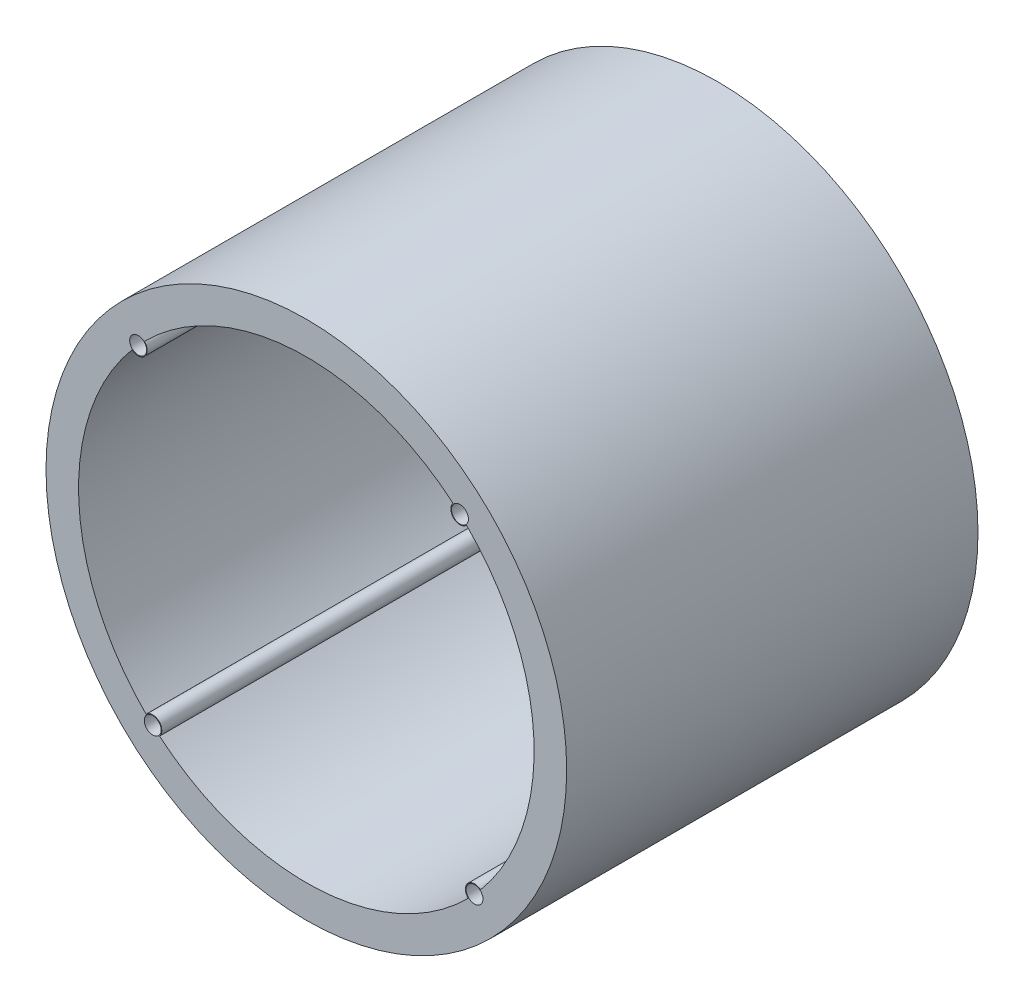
ISO-10303-21;
HEADER;
FILE_DESCRIPTION(('STEP AP214'),'2;1');
FILE_NAME('part.step','',(''),(''),'','','');
FILE_SCHEMA(('AUTOMOTIVE_DESIGN { 1 0 10303 214 1 1 1 1 }'));
ENDSEC;
DATA;
#1=APPLICATION_CONTEXT('core data for automotive mechanical design processes');
#2=APPLICATION_PROTOCOL_DEFINITION('international standard','automotive_design',2000,#1);
#3=PRODUCT_CONTEXT('',#1,'mechanical');
#4=PRODUCT('Part','Part','',(#3));
#5=PRODUCT_RELATED_PRODUCT_CATEGORY('part','',(#4));
#6=PRODUCT_DEFINITION_FORMATION('','',#4);
#7=PRODUCT_DEFINITION_CONTEXT('part definition',#1,'design');
#8=PRODUCT_DEFINITION('design','',#6,#7);
#9=PRODUCT_DEFINITION_SHAPE('','',#8);
#10=(LENGTH_UNIT() NAMED_UNIT(*) SI_UNIT(.MILLI.,.METRE.));
#11=(NAMED_UNIT(*) PLANE_ANGLE_UNIT() SI_UNIT($,.RADIAN.));
#12=(NAMED_UNIT(*) SI_UNIT($,.STERADIAN.) SOLID_ANGLE_UNIT());
#13=UNCERTAINTY_MEASURE_WITH_UNIT(LENGTH_MEASURE(1.E-05),#10,'distance_accuracy_value','');
#14=(GEOMETRIC_REPRESENTATION_CONTEXT(3) GLOBAL_UNCERTAINTY_ASSIGNED_CONTEXT((#13)) GLOBAL_UNIT_ASSIGNED_CONTEXT((#10,
#11,#12)) REPRESENTATION_CONTEXT('',''));
#15=CARTESIAN_POINT('',(0.,0.,0.));
#16=DIRECTION('',(0.,0.,1.));
#17=DIRECTION('',(1.,0.,0.));
#18=AXIS2_PLACEMENT_3D('',#15,#16,#17);
#19=CARTESIAN_POINT('',(0.,0.,0.));
#20=DIRECTION('',(0.,0.,1.));
#21=DIRECTION('',(1.,0.,0.));
#22=AXIS2_PLACEMENT_3D('',#19,#20,#21);
#23=CYLINDRICAL_SURFACE('',#22,44.45);
#24=CARTESIAN_POINT('',(0.,0.,0.));
#25=DIRECTION('',(0.,0.,1.));
#26=DIRECTION('',(1.,0.,0.));
#27=AXIS2_PLACEMENT_3D('',#24,#25,#26);
#28=CIRCLE('',#27,44.45);
#29=CARTESIAN_POINT('',(33.9917518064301,-28.6419850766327,0.));
#30=VERTEX_POINT('',#29);
#31=CARTESIAN_POINT('',(31.2669885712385,31.5939539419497,0.));
#32=VERTEX_POINT('',#31);
#33=EDGE_CURVE('E55',#30,#32,#28,.T.);
#34=ORIENTED_EDGE('',*,*,#33,.F.);
#35=DIRECTION('',(0.,0.,1.));
#36=VECTOR('',#35,1.);
#37=CARTESIAN_POINT('',(33.9917518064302,-28.6419850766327,40.1319999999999));
#38=LINE('',#37,#36);
#39=CARTESIAN_POINT('',(33.9917518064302,-28.6419850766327,80.2639999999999));
#40=VERTEX_POINT('',#39);
#41=EDGE_CURVE('E110',#30,#40,#38,.T.);
#42=ORIENTED_EDGE('',*,*,#41,.T.);
#43=CARTESIAN_POINT('',(0.,0.,80.2639999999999));
#44=DIRECTION('',(0.,0.,1.));
#45=DIRECTION('',(1.,0.,0.));
#46=AXIS2_PLACEMENT_3D('',#43,#44,#45);
#47=CIRCLE('',#46,44.45);
#48=CARTESIAN_POINT('',(31.2669885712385,31.5939539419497,80.2639999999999));
#49=VERTEX_POINT('',#48);
#50=EDGE_CURVE('E98',#40,#49,#47,.T.);
#51=ORIENTED_EDGE('',*,*,#50,.T.);
#52=DIRECTION('',(0.,0.,1.));
#53=VECTOR('',#52,1.);
#54=CARTESIAN_POINT('',(31.2669885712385,31.5939539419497,40.1319999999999));
#55=LINE('',#54,#53);
#56=EDGE_CURVE('E151',#49,#32,#55,.F.);
#57=ORIENTED_EDGE('',*,*,#56,.T.);
#58=EDGE_LOOP('',(#34,#42,#51,#57));
#59=FACE_BOUND('',#58,.T.);
#60=ADVANCED_FACE('F32',(#59),#23,.F.);
#61=CARTESIAN_POINT('',(-33.9917518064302,28.6419850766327,0.));
#62=VERTEX_POINT('',#61);
#63=CARTESIAN_POINT('',(-31.2669885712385,-31.5939539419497,0.));
#64=VERTEX_POINT('',#63);
#65=EDGE_CURVE('E145',#62,#64,#28,.T.);
#66=ORIENTED_EDGE('',*,*,#65,.F.);
#67=DIRECTION('',(0.,0.,1.));
#68=VECTOR('',#67,1.);
#69=CARTESIAN_POINT('',(-33.9917518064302,28.6419850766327,40.1319999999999));
#70=LINE('',#69,#68);
#71=CARTESIAN_POINT('',(-33.9917518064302,28.6419850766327,80.2639999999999));
#72=VERTEX_POINT('',#71);
#73=EDGE_CURVE('E11',#62,#72,#70,.T.);
#74=ORIENTED_EDGE('',*,*,#73,.T.);
#75=CARTESIAN_POINT('',(-31.2669885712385,-31.5939539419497,80.2639999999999));
#76=VERTEX_POINT('',#75);
#77=EDGE_CURVE('E108',#72,#76,#47,.T.);
#78=ORIENTED_EDGE('',*,*,#77,.T.);
#79=DIRECTION('',(0.,0.,1.));
#80=VECTOR('',#79,1.);
#81=CARTESIAN_POINT('',(-31.2669885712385,-31.5939539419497,40.1319999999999));
#82=LINE('',#81,#80);
#83=EDGE_CURVE('E158',#76,#64,#82,.F.);
#84=ORIENTED_EDGE('',*,*,#83,.T.);
#85=EDGE_LOOP('',(#66,#74,#78,#84));
#86=FACE_BOUND('',#85,.T.);
#87=ADVANCED_FACE('F177',(#86),#23,.F.);
#88=CARTESIAN_POINT('',(-28.6419850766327,-33.9917518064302,80.2639999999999));
#89=VERTEX_POINT('',#88);
#90=CARTESIAN_POINT('',(31.5939539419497,-31.2669885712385,80.2639999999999));
#91=VERTEX_POINT('',#90);
#92=EDGE_CURVE('E47',#89,#91,#47,.T.);
#93=ORIENTED_EDGE('',*,*,#92,.T.);
#94=DIRECTION('',(0.,0.,1.));
#95=VECTOR('',#94,1.);
#96=CARTESIAN_POINT('',(31.5939539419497,-31.2669885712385,40.1319999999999));
#97=LINE('',#96,#95);
#98=CARTESIAN_POINT('',(31.5939539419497,-31.2669885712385,0.));
#99=VERTEX_POINT('',#98);
#100=EDGE_CURVE('E115',#91,#99,#97,.F.);
#101=ORIENTED_EDGE('',*,*,#100,.T.);
#102=CARTESIAN_POINT('',(-28.6419850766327,-33.9917518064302,0.));
#103=VERTEX_POINT('',#102);
#104=EDGE_CURVE('E146',#103,#99,#28,.T.);
#105=ORIENTED_EDGE('',*,*,#104,.F.);
#106=DIRECTION('',(0.,0.,1.));
#107=VECTOR('',#106,1.);
#108=CARTESIAN_POINT('',(-28.6419850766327,-33.9917518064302,40.1319999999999));
#109=LINE('',#108,#107);
#110=EDGE_CURVE('E161',#103,#89,#109,.T.);
#111=ORIENTED_EDGE('',*,*,#110,.T.);
#112=EDGE_LOOP('',(#93,#101,#105,#111));
#113=FACE_BOUND('',#112,.T.);
#114=ADVANCED_FACE('F192',(#113),#23,.F.);
#115=CARTESIAN_POINT('',(0.,0.,80.2639999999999));
#116=DIRECTION('',(0.,0.,-1.));
#117=DIRECTION('',(-1.,0.,0.));
#118=AXIS2_PLACEMENT_3D('',#115,#116,#117);
#119=CYLINDRICAL_SURFACE('',#118,50.8);
#120=CARTESIAN_POINT('',(0.,0.,80.2639999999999));
#121=DIRECTION('',(0.,0.,1.));
#122=DIRECTION('',(1.,0.,0.));
#123=AXIS2_PLACEMENT_3D('',#120,#121,#122);
#124=CIRCLE('',#123,50.8);
#125=CARTESIAN_POINT('',(50.8,0.,80.2639999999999));
#126=VERTEX_POINT('',#125);
#127=EDGE_CURVE('E148',#126,#126,#124,.T.);
#128=ORIENTED_EDGE('',*,*,#127,.F.);
#129=EDGE_LOOP('',(#128));
#130=FACE_BOUND('',#129,.T.);
#131=CARTESIAN_POINT('',(0.,0.,0.));
#132=DIRECTION('',(0.,0.,1.));
#133=DIRECTION('',(1.,0.,0.));
#134=AXIS2_PLACEMENT_3D('',#131,#132,#133);
#135=CIRCLE('',#134,50.8);
#136=CARTESIAN_POINT('',(50.8,0.,0.));
#137=VERTEX_POINT('',#136);
#138=EDGE_CURVE('E144',#137,#137,#135,.T.);
#139=ORIENTED_EDGE('',*,*,#138,.T.);
#140=EDGE_LOOP('',(#139));
#141=FACE_BOUND('',#140,.T.);
#142=ADVANCED_FACE('F34',(#130,#141),#119,.T.);
#143=CARTESIAN_POINT('',(0.,0.,80.2639999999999));
#144=DIRECTION('',(0.,0.,1.));
#145=DIRECTION('',(1.,0.,0.));
#146=AXIS2_PLACEMENT_3D('',#143,#144,#145);
#147=PLANE('',#146);
#148=CARTESIAN_POINT('',(32.8191081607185,-29.9784695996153,80.2639999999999));
#149=DIRECTION('',(0.,0.,1.));
#150=DIRECTION('',(1.,0.,0.));
#151=AXIS2_PLACEMENT_3D('',#148,#149,#150);
#152=CIRCLE('',#151,1.651);
#153=CARTESIAN_POINT('',(34.4701081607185,-29.9784695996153,80.2639999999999));
#154=VERTEX_POINT('',#153);
#155=EDGE_CURVE('E235',#154,#154,#152,.T.);
#156=ORIENTED_EDGE('',*,*,#155,.F.);
#157=EDGE_LOOP('',(#156));
#158=FACE_BOUND('',#157,.T.);
#159=CARTESIAN_POINT('',(-29.9784695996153,-32.8191081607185,80.2639999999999));
#160=DIRECTION('',(0.,0.,1.));
#161=DIRECTION('',(1.,0.,0.));
#162=AXIS2_PLACEMENT_3D('',#159,#160,#161);
#163=CIRCLE('',#162,1.651);
#164=CARTESIAN_POINT('',(-28.3274695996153,-32.8191081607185,80.2639999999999));
#165=VERTEX_POINT('',#164);
#166=EDGE_CURVE('E231',#165,#165,#163,.T.);
#167=ORIENTED_EDGE('',*,*,#166,.F.);
#168=EDGE_LOOP('',(#167));
#169=FACE_BOUND('',#168,.T.);
#170=CARTESIAN_POINT('',(-32.8191081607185,29.9784695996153,80.2639999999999));
#171=DIRECTION('',(0.,0.,1.));
#172=DIRECTION('',(1.,0.,0.));
#173=AXIS2_PLACEMENT_3D('',#170,#171,#172);
#174=CIRCLE('',#173,1.651);
#175=CARTESIAN_POINT('',(-31.1681081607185,29.9784695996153,80.2639999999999));
#176=VERTEX_POINT('',#175);
#177=EDGE_CURVE('E226',#176,#176,#174,.T.);
#178=ORIENTED_EDGE('',*,*,#177,.F.);
#179=EDGE_LOOP('',(#178));
#180=FACE_BOUND('',#179,.T.);
#181=CARTESIAN_POINT('',(29.9784695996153,32.8191081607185,80.2639999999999));
#182=DIRECTION('',(0.,0.,1.));
#183=DIRECTION('',(1.,0.,0.));
#184=AXIS2_PLACEMENT_3D('',#181,#182,#183);
#185=CIRCLE('',#184,1.651);
#186=CARTESIAN_POINT('',(31.6294695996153,32.8191081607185,80.2639999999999));
#187=VERTEX_POINT('',#186);
#188=EDGE_CURVE('E123',#187,#187,#185,.T.);
#189=ORIENTED_EDGE('',*,*,#188,.F.);
#190=EDGE_LOOP('',(#189));
#191=FACE_BOUND('',#190,.T.);
#192=ORIENTED_EDGE('',*,*,#50,.F.);
#193=CARTESIAN_POINT('',(32.8191081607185,-29.9784695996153,80.2639999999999));
#194=DIRECTION('',(0.,0.,1.));
#195=DIRECTION('',(1.,0.,0.));
#196=AXIS2_PLACEMENT_3D('',#193,#194,#195);
#197=CIRCLE('',#196,1.778);
#198=EDGE_CURVE('E102',#40,#91,#197,.T.);
#199=ORIENTED_EDGE('',*,*,#198,.T.);
#200=ORIENTED_EDGE('',*,*,#92,.F.);
#201=CARTESIAN_POINT('',(-29.9784695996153,-32.8191081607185,80.2639999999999));
#202=DIRECTION('',(0.,0.,1.));
#203=DIRECTION('',(1.,0.,0.));
#204=AXIS2_PLACEMENT_3D('',#201,#202,#203);
#205=CIRCLE('',#204,1.778);
#206=EDGE_CURVE('E131',#89,#76,#205,.T.);
#207=ORIENTED_EDGE('',*,*,#206,.T.);
#208=ORIENTED_EDGE('',*,*,#77,.F.);
#209=CARTESIAN_POINT('',(-32.8191081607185,29.9784695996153,80.2639999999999));
#210=DIRECTION('',(0.,0.,1.));
#211=DIRECTION('',(1.,0.,0.));
#212=AXIS2_PLACEMENT_3D('',#209,#210,#211);
#213=CIRCLE('',#212,1.778);
#214=CARTESIAN_POINT('',(-31.5939539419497,31.2669885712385,80.2639999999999));
#215=VERTEX_POINT('',#214);
#216=EDGE_CURVE('E114',#72,#215,#213,.T.);
#217=ORIENTED_EDGE('',*,*,#216,.T.);
#218=CARTESIAN_POINT('',(28.6419850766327,33.9917518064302,80.2639999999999));
#219=VERTEX_POINT('',#218);
#220=EDGE_CURVE('E109',#219,#215,#47,.T.);
#221=ORIENTED_EDGE('',*,*,#220,.F.);
#222=CARTESIAN_POINT('',(29.9784695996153,32.8191081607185,80.2639999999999));
#223=DIRECTION('',(0.,0.,1.));
#224=DIRECTION('',(1.,0.,0.));
#225=AXIS2_PLACEMENT_3D('',#222,#223,#224);
#226=CIRCLE('',#225,1.778);
#227=EDGE_CURVE('E104',#219,#49,#226,.T.);
#228=ORIENTED_EDGE('',*,*,#227,.T.);
#229=EDGE_LOOP('',(#192,#199,#200,#207,#208,#217,#221,#228));
#230=FACE_BOUND('',#229,.T.);
#231=ORIENTED_EDGE('',*,*,#127,.T.);
#232=EDGE_LOOP('',(#231));
#233=FACE_BOUND('',#232,.T.);
#234=ADVANCED_FACE('F99',(#158,#169,#180,#191,#230,#233),#147,.T.);
#235=CARTESIAN_POINT('',(0.,0.,0.));
#236=DIRECTION('',(0.,0.,1.));
#237=DIRECTION('',(1.,0.,0.));
#238=AXIS2_PLACEMENT_3D('',#235,#236,#237);
#239=PLANE('',#238);
#240=CARTESIAN_POINT('',(32.8191081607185,-29.9784695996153,0.));
#241=DIRECTION('',(0.,0.,1.));
#242=DIRECTION('',(1.,0.,0.));
#243=AXIS2_PLACEMENT_3D('',#240,#241,#242);
#244=CIRCLE('',#243,1.651);
#245=CARTESIAN_POINT('',(34.4701081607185,-29.9784695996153,0.));
#246=VERTEX_POINT('',#245);
#247=EDGE_CURVE('E207',#246,#246,#244,.T.);
#248=ORIENTED_EDGE('',*,*,#247,.T.);
#249=EDGE_LOOP('',(#248));
#250=FACE_BOUND('',#249,.T.);
#251=CARTESIAN_POINT('',(-29.9784695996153,-32.8191081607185,0.));
#252=DIRECTION('',(0.,0.,1.));
#253=DIRECTION('',(1.,0.,0.));
#254=AXIS2_PLACEMENT_3D('',#251,#252,#253);
#255=CIRCLE('',#254,1.651);
#256=CARTESIAN_POINT('',(-28.3274695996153,-32.8191081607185,0.));
#257=VERTEX_POINT('',#256);
#258=EDGE_CURVE('E211',#257,#257,#255,.T.);
#259=ORIENTED_EDGE('',*,*,#258,.T.);
#260=EDGE_LOOP('',(#259));
#261=FACE_BOUND('',#260,.T.);
#262=CARTESIAN_POINT('',(-32.8191081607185,29.9784695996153,0.));
#263=DIRECTION('',(0.,0.,1.));
#264=DIRECTION('',(1.,0.,0.));
#265=AXIS2_PLACEMENT_3D('',#262,#263,#264);
#266=CIRCLE('',#265,1.651);
#267=CARTESIAN_POINT('',(-31.1681081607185,29.9784695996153,0.));
#268=VERTEX_POINT('',#267);
#269=EDGE_CURVE('E215',#268,#268,#266,.T.);
#270=ORIENTED_EDGE('',*,*,#269,.T.);
#271=EDGE_LOOP('',(#270));
#272=FACE_BOUND('',#271,.T.);
#273=CARTESIAN_POINT('',(29.9784695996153,32.8191081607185,0.));
#274=DIRECTION('',(0.,0.,1.));
#275=DIRECTION('',(1.,0.,0.));
#276=AXIS2_PLACEMENT_3D('',#273,#274,#275);
#277=CIRCLE('',#276,1.651);
#278=CARTESIAN_POINT('',(31.6294695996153,32.8191081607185,0.));
#279=VERTEX_POINT('',#278);
#280=EDGE_CURVE('E119',#279,#279,#277,.T.);
#281=ORIENTED_EDGE('',*,*,#280,.T.);
#282=EDGE_LOOP('',(#281));
#283=FACE_BOUND('',#282,.T.);
#284=ORIENTED_EDGE('',*,*,#104,.T.);
#285=CARTESIAN_POINT('',(32.8191081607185,-29.9784695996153,0.));
#286=DIRECTION('',(0.,0.,1.));
#287=DIRECTION('',(1.,0.,0.));
#288=AXIS2_PLACEMENT_3D('',#285,#286,#287);
#289=CIRCLE('',#288,1.778);
#290=EDGE_CURVE('E118',#30,#99,#289,.T.);
#291=ORIENTED_EDGE('',*,*,#290,.F.);
#292=ORIENTED_EDGE('',*,*,#33,.T.);
#293=CARTESIAN_POINT('',(29.9784695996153,32.8191081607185,0.));
#294=DIRECTION('',(0.,0.,1.));
#295=DIRECTION('',(1.,0.,0.));
#296=AXIS2_PLACEMENT_3D('',#293,#294,#295);
#297=CIRCLE('',#296,1.778);
#298=CARTESIAN_POINT('',(28.6419850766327,33.9917518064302,0.));
#299=VERTEX_POINT('',#298);
#300=EDGE_CURVE('E106',#299,#32,#297,.T.);
#301=ORIENTED_EDGE('',*,*,#300,.F.);
#302=CARTESIAN_POINT('',(-31.5939539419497,31.2669885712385,0.));
#303=VERTEX_POINT('',#302);
#304=EDGE_CURVE('E142',#299,#303,#28,.T.);
#305=ORIENTED_EDGE('',*,*,#304,.T.);
#306=CARTESIAN_POINT('',(-32.8191081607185,29.9784695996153,-1.2490009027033E-13));
#307=DIRECTION('',(0.,0.,1.));
#308=DIRECTION('',(1.,0.,0.));
#309=AXIS2_PLACEMENT_3D('',#306,#307,#308);
#310=CIRCLE('',#309,1.778);
#311=EDGE_CURVE('E128',#62,#303,#310,.T.);
#312=ORIENTED_EDGE('',*,*,#311,.F.);
#313=ORIENTED_EDGE('',*,*,#65,.T.);
#314=CARTESIAN_POINT('',(-29.9784695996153,-32.8191081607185,-1.2490009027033E-13));
#315=DIRECTION('',(0.,0.,1.));
#316=DIRECTION('',(1.,0.,0.));
#317=AXIS2_PLACEMENT_3D('',#314,#315,#316);
#318=CIRCLE('',#317,1.778);
#319=EDGE_CURVE('E134',#103,#64,#318,.T.);
#320=ORIENTED_EDGE('',*,*,#319,.F.);
#321=EDGE_LOOP('',(#284,#291,#292,#301,#305,#312,#313,#320));
#322=FACE_BOUND('',#321,.T.);
#323=ORIENTED_EDGE('',*,*,#138,.F.);
#324=EDGE_LOOP('',(#323));
#325=FACE_BOUND('',#324,.T.);
#326=ADVANCED_FACE('F172',(#250,#261,#272,#283,#322,#325),#239,.F.);
#327=ORIENTED_EDGE('',*,*,#220,.T.);
#328=DIRECTION('',(0.,0.,1.));
#329=VECTOR('',#328,1.);
#330=CARTESIAN_POINT('',(-31.5939539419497,31.2669885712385,40.1319999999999));
#331=LINE('',#330,#329);
#332=EDGE_CURVE('E40',#215,#303,#331,.F.);
#333=ORIENTED_EDGE('',*,*,#332,.T.);
#334=ORIENTED_EDGE('',*,*,#304,.F.);
#335=DIRECTION('',(0.,0.,1.));
#336=VECTOR('',#335,1.);
#337=CARTESIAN_POINT('',(28.6419850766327,33.9917518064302,40.1319999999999));
#338=LINE('',#337,#336);
#339=EDGE_CURVE('E155',#299,#219,#338,.T.);
#340=ORIENTED_EDGE('',*,*,#339,.T.);
#341=EDGE_LOOP('',(#327,#333,#334,#340));
#342=FACE_BOUND('',#341,.T.);
#343=ADVANCED_FACE('F164',(#342),#23,.F.);
#344=CARTESIAN_POINT('',(29.9784695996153,32.8191081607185,0.));
#345=DIRECTION('',(0.,0.,1.));
#346=DIRECTION('',(1.,0.,0.));
#347=AXIS2_PLACEMENT_3D('',#344,#345,#346);
#348=CYLINDRICAL_SURFACE('',#347,1.778);
#349=ORIENTED_EDGE('',*,*,#339,.F.);
#350=ORIENTED_EDGE('',*,*,#300,.T.);
#351=ORIENTED_EDGE('',*,*,#56,.F.);
#352=ORIENTED_EDGE('',*,*,#227,.F.);
#353=EDGE_LOOP('',(#349,#350,#351,#352));
#354=FACE_BOUND('',#353,.T.);
#355=ADVANCED_FACE('F181',(#354),#348,.T.);
#356=CARTESIAN_POINT('',(-29.9784695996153,-32.8191081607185,-1.2490009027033E-13));
#357=DIRECTION('',(0.,0.,1.));
#358=DIRECTION('',(1.,0.,0.));
#359=AXIS2_PLACEMENT_3D('',#356,#357,#358);
#360=CYLINDRICAL_SURFACE('',#359,1.778);
#361=ORIENTED_EDGE('',*,*,#110,.F.);
#362=ORIENTED_EDGE('',*,*,#319,.T.);
#363=ORIENTED_EDGE('',*,*,#83,.F.);
#364=ORIENTED_EDGE('',*,*,#206,.F.);
#365=EDGE_LOOP('',(#361,#362,#363,#364));
#366=FACE_BOUND('',#365,.T.);
#367=ADVANCED_FACE('F183',(#366),#360,.T.);
#368=CARTESIAN_POINT('',(-32.8191081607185,29.9784695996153,-1.2490009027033E-13));
#369=DIRECTION('',(0.,0.,1.));
#370=DIRECTION('',(1.,0.,0.));
#371=AXIS2_PLACEMENT_3D('',#368,#369,#370);
#372=CYLINDRICAL_SURFACE('',#371,1.778);
#373=ORIENTED_EDGE('',*,*,#73,.F.);
#374=ORIENTED_EDGE('',*,*,#311,.T.);
#375=ORIENTED_EDGE('',*,*,#332,.F.);
#376=ORIENTED_EDGE('',*,*,#216,.F.);
#377=EDGE_LOOP('',(#373,#374,#375,#376));
#378=FACE_BOUND('',#377,.T.);
#379=ADVANCED_FACE('F175',(#378),#372,.T.);
#380=CARTESIAN_POINT('',(32.8191081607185,-29.9784695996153,0.));
#381=DIRECTION('',(0.,0.,1.));
#382=DIRECTION('',(1.,0.,0.));
#383=AXIS2_PLACEMENT_3D('',#380,#381,#382);
#384=CYLINDRICAL_SURFACE('',#383,1.778);
#385=ORIENTED_EDGE('',*,*,#41,.F.);
#386=ORIENTED_EDGE('',*,*,#290,.T.);
#387=ORIENTED_EDGE('',*,*,#100,.F.);
#388=ORIENTED_EDGE('',*,*,#198,.F.);
#389=EDGE_LOOP('',(#385,#386,#387,#388));
#390=FACE_BOUND('',#389,.T.);
#391=ADVANCED_FACE('F117',(#390),#384,.T.);
#392=CARTESIAN_POINT('',(29.9784695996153,32.8191081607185,0.));
#393=DIRECTION('',(0.,0.,1.));
#394=DIRECTION('',(1.,0.,0.));
#395=AXIS2_PLACEMENT_3D('',#392,#393,#394);
#396=CYLINDRICAL_SURFACE('',#395,1.651);
#397=ORIENTED_EDGE('',*,*,#280,.F.);
#398=EDGE_LOOP('',(#397));
#399=FACE_BOUND('',#398,.T.);
#400=ORIENTED_EDGE('',*,*,#188,.T.);
#401=EDGE_LOOP('',(#400));
#402=FACE_BOUND('',#401,.T.);
#403=ADVANCED_FACE('F218',(#399,#402),#396,.F.);
#404=CARTESIAN_POINT('',(-32.8191081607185,29.9784695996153,0.));
#405=DIRECTION('',(0.,0.,1.));
#406=DIRECTION('',(1.,0.,0.));
#407=AXIS2_PLACEMENT_3D('',#404,#405,#406);
#408=CYLINDRICAL_SURFACE('',#407,1.651);
#409=ORIENTED_EDGE('',*,*,#269,.F.);
#410=EDGE_LOOP('',(#409));
#411=FACE_BOUND('',#410,.T.);
#412=ORIENTED_EDGE('',*,*,#177,.T.);
#413=EDGE_LOOP('',(#412));
#414=FACE_BOUND('',#413,.T.);
#415=ADVANCED_FACE('F221',(#411,#414),#408,.F.);
#416=CARTESIAN_POINT('',(-29.9784695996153,-32.8191081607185,0.));
#417=DIRECTION('',(0.,0.,1.));
#418=DIRECTION('',(1.,0.,0.));
#419=AXIS2_PLACEMENT_3D('',#416,#417,#418);
#420=CYLINDRICAL_SURFACE('',#419,1.651);
#421=ORIENTED_EDGE('',*,*,#258,.F.);
#422=EDGE_LOOP('',(#421));
#423=FACE_BOUND('',#422,.T.);
#424=ORIENTED_EDGE('',*,*,#166,.T.);
#425=EDGE_LOOP('',(#424));
#426=FACE_BOUND('',#425,.T.);
#427=ADVANCED_FACE('F247',(#423,#426),#420,.F.);
#428=CARTESIAN_POINT('',(32.8191081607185,-29.9784695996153,0.));
#429=DIRECTION('',(0.,0.,1.));
#430=DIRECTION('',(1.,0.,0.));
#431=AXIS2_PLACEMENT_3D('',#428,#429,#430);
#432=CYLINDRICAL_SURFACE('',#431,1.651);
#433=ORIENTED_EDGE('',*,*,#247,.F.);
#434=EDGE_LOOP('',(#433));
#435=FACE_BOUND('',#434,.T.);
#436=ORIENTED_EDGE('',*,*,#155,.T.);
#437=EDGE_LOOP('',(#436));
#438=FACE_BOUND('',#437,.T.);
#439=ADVANCED_FACE('F240',(#435,#438),#432,.F.);
#440=CLOSED_SHELL('',(#60,#87,#114,#142,#234,#326,#343,#355,#367,#379,#391,#403,#415,#427,#439));
#441=MANIFOLD_SOLID_BREP('B2',#440);
#442=ADVANCED_BREP_SHAPE_REPRESENTATION('',(#18,#441),#14);
#443=SHAPE_DEFINITION_REPRESENTATION(#9,#442);
ENDSEC;
END-ISO-10303-21;
